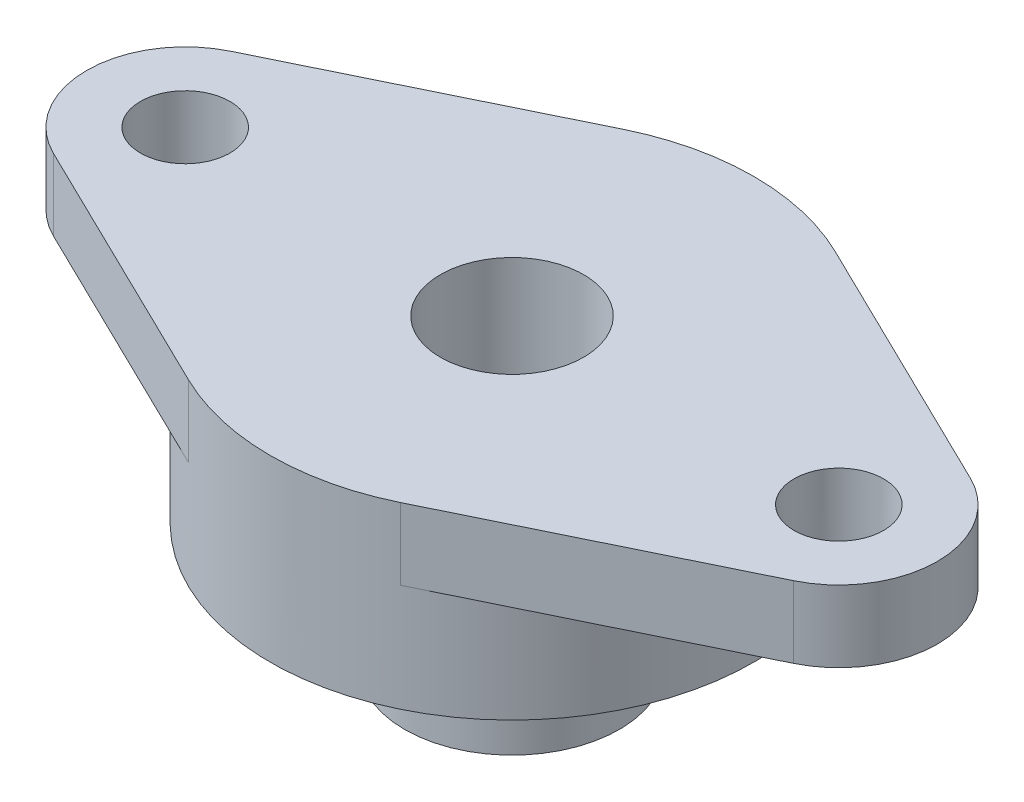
ISO-10303-21;
HEADER;
FILE_DESCRIPTION(('STEP AP214'),'2;1');
FILE_NAME('part.step','',(''),(''),'','','');
FILE_SCHEMA(('AUTOMOTIVE_DESIGN { 1 0 10303 214 1 1 1 1 }'));
ENDSEC;
DATA;
#1=APPLICATION_CONTEXT('core data for automotive mechanical design processes');
#2=APPLICATION_PROTOCOL_DEFINITION('international standard','automotive_design',2000,#1);
#3=PRODUCT_CONTEXT('',#1,'mechanical');
#4=PRODUCT('Part','Part','',(#3));
#5=PRODUCT_RELATED_PRODUCT_CATEGORY('part','',(#4));
#6=PRODUCT_DEFINITION_FORMATION('','',#4);
#7=PRODUCT_DEFINITION_CONTEXT('part definition',#1,'design');
#8=PRODUCT_DEFINITION('design','',#6,#7);
#9=PRODUCT_DEFINITION_SHAPE('','',#8);
#10=(LENGTH_UNIT() NAMED_UNIT(*) SI_UNIT(.MILLI.,.METRE.));
#11=(NAMED_UNIT(*) PLANE_ANGLE_UNIT() SI_UNIT($,.RADIAN.));
#12=(NAMED_UNIT(*) SI_UNIT($,.STERADIAN.) SOLID_ANGLE_UNIT());
#13=UNCERTAINTY_MEASURE_WITH_UNIT(LENGTH_MEASURE(1.E-05),#10,'distance_accuracy_value','');
#14=(GEOMETRIC_REPRESENTATION_CONTEXT(3) GLOBAL_UNCERTAINTY_ASSIGNED_CONTEXT((#13)) GLOBAL_UNIT_ASSIGNED_CONTEXT((#10,
#11,#12)) REPRESENTATION_CONTEXT('',''));
#15=CARTESIAN_POINT('',(0.,0.,0.));
#16=DIRECTION('',(0.,0.,1.));
#17=DIRECTION('',(1.,0.,0.));
#18=AXIS2_PLACEMENT_3D('',#15,#16,#17);
#19=CARTESIAN_POINT('',(18.2499999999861,0.,-7.3341526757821E-11));
#20=DIRECTION('',(0.,-1.,0.));
#21=DIRECTION('',(0.,0.,-1.));
#22=AXIS2_PLACEMENT_3D('',#19,#20,#21);
#23=PLANE('',#22);
#24=CARTESIAN_POINT('',(18.25,0.,0.));
#25=DIRECTION('',(0.,-1.,0.));
#26=DIRECTION('',(0.,0.,-1.));
#27=AXIS2_PLACEMENT_3D('',#24,#25,#26);
#28=CIRCLE('',#27,2.49999999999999);
#29=CARTESIAN_POINT('',(18.25,0.,-2.49999999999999));
#30=VERTEX_POINT('',#29);
#31=EDGE_CURVE('E263',#30,#30,#28,.T.);
#32=ORIENTED_EDGE('',*,*,#31,.F.);
#33=EDGE_LOOP('',(#32));
#34=FACE_BOUND('',#33,.T.);
#35=CARTESIAN_POINT('',(0.,0.,0.));
#36=DIRECTION('',(0.,-1.,0.));
#37=DIRECTION('',(0.,0.,-1.));
#38=AXIS2_PLACEMENT_3D('',#35,#36,#37);
#39=CIRCLE('',#38,13.5);
#40=CARTESIAN_POINT('',(5.91780821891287,0.,-12.1338182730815));
#41=VERTEX_POINT('',#40);
#42=CARTESIAN_POINT('',(5.91780821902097,0.,12.1338182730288));
#43=VERTEX_POINT('',#42);
#44=EDGE_CURVE('E266',#41,#43,#39,.T.);
#45=ORIENTED_EDGE('',*,*,#44,.F.);
#46=DIRECTION('',(0.898801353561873,0.,0.438356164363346));
#47=VECTOR('',#46,1.);
#48=CARTESIAN_POINT('',(5.91780821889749,0.,-12.13381827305));
#49=LINE('',#48,#47);
#50=CARTESIAN_POINT('',(20.6609589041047,0.,-4.94340744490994));
#51=VERTEX_POINT('',#50);
#52=EDGE_CURVE('E164',#41,#51,#49,.T.);
#53=ORIENTED_EDGE('',*,*,#52,.T.);
#54=CARTESIAN_POINT('',(18.2499999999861,0.,-7.3341526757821E-11));
#55=DIRECTION('',(0.,-1.,0.));
#56=DIRECTION('',(0.,0.,-1.));
#57=AXIS2_PLACEMENT_3D('',#54,#55,#56);
#58=CIRCLE('',#57,5.50000000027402);
#59=CARTESIAN_POINT('',(20.660958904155,0.,4.94340744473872));
#60=VERTEX_POINT('',#59);
#61=EDGE_CURVE('E149',#51,#60,#58,.T.);
#62=ORIENTED_EDGE('',*,*,#61,.T.);
#63=DIRECTION('',(-0.898801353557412,0.,0.438356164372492));
#64=VECTOR('',#63,1.);
#65=CARTESIAN_POINT('',(20.660958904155,0.,4.94340744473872));
#66=LINE('',#65,#64);
#67=EDGE_CURVE('E152',#60,#43,#66,.T.);
#68=ORIENTED_EDGE('',*,*,#67,.T.);
#69=EDGE_LOOP('',(#45,#53,#62,#68));
#70=FACE_BOUND('',#69,.T.);
#71=ADVANCED_FACE('F43',(#34,#70),#23,.T.);
#72=CARTESIAN_POINT('',(18.2499999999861,4.,-7.3341526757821E-11));
#73=DIRECTION('',(0.,-1.,0.));
#74=DIRECTION('',(0.,0.,-1.));
#75=AXIS2_PLACEMENT_3D('',#72,#73,#74);
#76=CYLINDRICAL_SURFACE('',#75,5.50000000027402);
#77=ORIENTED_EDGE('',*,*,#61,.F.);
#78=DIRECTION('',(0.,-1.,0.));
#79=VECTOR('',#78,1.);
#80=CARTESIAN_POINT('',(20.6609589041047,4.,-4.94340744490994));
#81=LINE('',#80,#79);
#82=CARTESIAN_POINT('',(20.6609589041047,4.,-4.94340744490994));
#83=VERTEX_POINT('',#82);
#84=EDGE_CURVE('E65',#83,#51,#81,.T.);
#85=ORIENTED_EDGE('',*,*,#84,.F.);
#86=CARTESIAN_POINT('',(18.2499999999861,4.,-7.3341526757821E-11));
#87=DIRECTION('',(0.,-1.,0.));
#88=DIRECTION('',(0.,0.,-1.));
#89=AXIS2_PLACEMENT_3D('',#86,#87,#88);
#90=CIRCLE('',#89,5.50000000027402);
#91=CARTESIAN_POINT('',(20.660958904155,4.,4.94340744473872));
#92=VERTEX_POINT('',#91);
#93=EDGE_CURVE('E167',#83,#92,#90,.T.);
#94=ORIENTED_EDGE('',*,*,#93,.T.);
#95=DIRECTION('',(0.,-1.,0.));
#96=VECTOR('',#95,1.);
#97=CARTESIAN_POINT('',(20.660958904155,4.,4.94340744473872));
#98=LINE('',#97,#96);
#99=EDGE_CURVE('E105',#92,#60,#98,.T.);
#100=ORIENTED_EDGE('',*,*,#99,.T.);
#101=EDGE_LOOP('',(#77,#85,#94,#100));
#102=FACE_BOUND('',#101,.T.);
#103=ADVANCED_FACE('F45',(#102),#76,.T.);
#104=CARTESIAN_POINT('',(5.91780821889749,4.,-12.13381827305));
#105=DIRECTION('',(0.438356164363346,0.,-0.898801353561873));
#106=DIRECTION('',(-0.898801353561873,0.,-0.438356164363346));
#107=AXIS2_PLACEMENT_3D('',#104,#105,#106);
#108=PLANE('',#107);
#109=ORIENTED_EDGE('',*,*,#52,.F.);
#110=DIRECTION('',(0.,-1.,0.));
#111=VECTOR('',#110,1.);
#112=CARTESIAN_POINT('',(5.91780821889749,4.,-12.13381827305));
#113=LINE('',#112,#111);
#114=CARTESIAN_POINT('',(5.91780821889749,4.,-12.13381827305));
#115=VERTEX_POINT('',#114);
#116=EDGE_CURVE('E130',#115,#41,#113,.T.);
#117=ORIENTED_EDGE('',*,*,#116,.F.);
#118=DIRECTION('',(0.898801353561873,0.,0.438356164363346));
#119=VECTOR('',#118,1.);
#120=CARTESIAN_POINT('',(5.91780821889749,4.,-12.13381827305));
#121=LINE('',#120,#119);
#122=EDGE_CURVE('E139',#115,#83,#121,.T.);
#123=ORIENTED_EDGE('',*,*,#122,.T.);
#124=ORIENTED_EDGE('',*,*,#84,.T.);
#125=EDGE_LOOP('',(#109,#117,#123,#124));
#126=FACE_BOUND('',#125,.T.);
#127=ADVANCED_FACE('F236',(#126),#108,.T.);
#128=CARTESIAN_POINT('',(0.,4.,1.95185047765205E-11));
#129=DIRECTION('',(0.,-1.,0.));
#130=DIRECTION('',(0.,0.,-1.));
#131=AXIS2_PLACEMENT_3D('',#128,#129,#130);
#132=CYLINDRICAL_SURFACE('',#131,13.4999999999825);
#133=ORIENTED_EDGE('',*,*,#116,.T.);
#134=ORIENTED_EDGE('',*,*,#44,.T.);
#135=DIRECTION('',(0.,-1.,0.));
#136=VECTOR('',#135,1.);
#137=CARTESIAN_POINT('',(5.91780821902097,4.,12.1338182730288));
#138=LINE('',#137,#136);
#139=CARTESIAN_POINT('',(5.91780821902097,4.,12.1338182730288));
#140=VERTEX_POINT('',#139);
#141=EDGE_CURVE('E175',#140,#43,#138,.T.);
#142=ORIENTED_EDGE('',*,*,#141,.F.);
#143=CARTESIAN_POINT('',(0.,4.,1.95185047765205E-11));
#144=DIRECTION('',(0.,-1.,0.));
#145=DIRECTION('',(0.,0.,-1.));
#146=AXIS2_PLACEMENT_3D('',#143,#144,#145);
#147=CIRCLE('',#146,13.4999999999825);
#148=CARTESIAN_POINT('',(-5.91780821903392,4.,12.1338182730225));
#149=VERTEX_POINT('',#148);
#150=EDGE_CURVE('E278',#140,#149,#147,.T.);
#151=ORIENTED_EDGE('',*,*,#150,.T.);
#152=DIRECTION('',(0.,-1.,0.));
#153=VECTOR('',#152,1.);
#154=CARTESIAN_POINT('',(-5.91780821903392,4.,12.1338182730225));
#155=LINE('',#154,#153);
#156=CARTESIAN_POINT('',(-5.91780821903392,0.,12.1338182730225));
#157=VERTEX_POINT('',#156);
#158=EDGE_CURVE('E173',#149,#157,#155,.T.);
#159=ORIENTED_EDGE('',*,*,#158,.T.);
#160=CARTESIAN_POINT('',(-5.91780821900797,0.,-12.1338182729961));
#161=VERTEX_POINT('',#160);
#162=EDGE_CURVE('E129',#157,#161,#39,.T.);
#163=ORIENTED_EDGE('',*,*,#162,.T.);
#164=DIRECTION('',(0.,-1.,0.));
#165=VECTOR('',#164,1.);
#166=CARTESIAN_POINT('',(-5.91780821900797,4.,-12.1338182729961));
#167=LINE('',#166,#165);
#168=CARTESIAN_POINT('',(-5.91780821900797,4.,-12.1338182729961));
#169=VERTEX_POINT('',#168);
#170=EDGE_CURVE('E93',#169,#161,#167,.T.);
#171=ORIENTED_EDGE('',*,*,#170,.F.);
#172=CARTESIAN_POINT('',(0.,4.,1.95185047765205E-11));
#173=DIRECTION('',(0.,-1.,0.));
#174=DIRECTION('',(0.,0.,-1.));
#175=AXIS2_PLACEMENT_3D('',#172,#173,#174);
#176=CIRCLE('',#175,13.4999999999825);
#177=EDGE_CURVE('E126',#169,#115,#176,.T.);
#178=ORIENTED_EDGE('',*,*,#177,.T.);
#179=EDGE_LOOP('',(#133,#134,#142,#151,#159,#163,#171,#178));
#180=FACE_BOUND('',#179,.T.);
#181=CARTESIAN_POINT('',(0.,-6.,0.));
#182=DIRECTION('',(0.,-1.,0.));
#183=DIRECTION('',(0.,0.,-1.));
#184=AXIS2_PLACEMENT_3D('',#181,#182,#183);
#185=CIRCLE('',#184,13.5);
#186=CARTESIAN_POINT('',(0.,-6.,-13.5));
#187=VERTEX_POINT('',#186);
#188=EDGE_CURVE('E153',#187,#187,#185,.T.);
#189=ORIENTED_EDGE('',*,*,#188,.F.);
#190=EDGE_LOOP('',(#189));
#191=FACE_BOUND('',#190,.T.);
#192=ADVANCED_FACE('F124',(#180,#191),#132,.T.);
#193=CARTESIAN_POINT('',(-20.6609589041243,4.,-4.94340744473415));
#194=DIRECTION('',(-0.438356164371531,0.,-0.898801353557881));
#195=DIRECTION('',(-0.898801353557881,0.,0.438356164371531));
#196=AXIS2_PLACEMENT_3D('',#193,#194,#195);
#197=PLANE('',#196);
#198=DIRECTION('',(0.898801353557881,0.,-0.438356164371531));
#199=VECTOR('',#198,1.);
#200=CARTESIAN_POINT('',(-20.6609589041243,0.,-4.94340744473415));
#201=LINE('',#200,#199);
#202=CARTESIAN_POINT('',(-20.6609589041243,0.,-4.94340744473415));
#203=VERTEX_POINT('',#202);
#204=EDGE_CURVE('E162',#203,#161,#201,.T.);
#205=ORIENTED_EDGE('',*,*,#204,.F.);
#206=DIRECTION('',(0.,-1.,0.));
#207=VECTOR('',#206,1.);
#208=CARTESIAN_POINT('',(-20.6609589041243,4.,-4.94340744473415));
#209=LINE('',#208,#207);
#210=CARTESIAN_POINT('',(-20.6609589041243,4.,-4.94340744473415));
#211=VERTEX_POINT('',#210);
#212=EDGE_CURVE('E131',#211,#203,#209,.T.);
#213=ORIENTED_EDGE('',*,*,#212,.F.);
#214=DIRECTION('',(0.898801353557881,0.,-0.438356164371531));
#215=VECTOR('',#214,1.);
#216=CARTESIAN_POINT('',(-20.6609589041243,4.,-4.94340744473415));
#217=LINE('',#216,#215);
#218=EDGE_CURVE('E137',#211,#169,#217,.T.);
#219=ORIENTED_EDGE('',*,*,#218,.T.);
#220=ORIENTED_EDGE('',*,*,#170,.T.);
#221=EDGE_LOOP('',(#205,#213,#219,#220));
#222=FACE_BOUND('',#221,.T.);
#223=ADVANCED_FACE('F141',(#222),#197,.T.);
#224=CARTESIAN_POINT('',(-18.25,4.,0.));
#225=DIRECTION('',(0.,-1.,0.));
#226=DIRECTION('',(0.,0.,-1.));
#227=AXIS2_PLACEMENT_3D('',#224,#225,#226);
#228=CYLINDRICAL_SURFACE('',#227,5.50000000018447);
#229=CARTESIAN_POINT('',(-18.25,0.,0.));
#230=DIRECTION('',(0.,-1.,0.));
#231=DIRECTION('',(0.,0.,-1.));
#232=AXIS2_PLACEMENT_3D('',#229,#230,#231);
#233=CIRCLE('',#232,5.50000000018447);
#234=CARTESIAN_POINT('',(-20.6609589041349,0.,4.94340744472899));
#235=VERTEX_POINT('',#234);
#236=EDGE_CURVE('E159',#235,#203,#233,.T.);
#237=ORIENTED_EDGE('',*,*,#236,.F.);
#238=DIRECTION('',(0.,-1.,0.));
#239=VECTOR('',#238,1.);
#240=CARTESIAN_POINT('',(-20.6609589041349,4.,4.94340744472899));
#241=LINE('',#240,#239);
#242=CARTESIAN_POINT('',(-20.6609589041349,4.,4.94340744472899));
#243=VERTEX_POINT('',#242);
#244=EDGE_CURVE('E171',#243,#235,#241,.T.);
#245=ORIENTED_EDGE('',*,*,#244,.F.);
#246=CARTESIAN_POINT('',(-18.25,4.,0.));
#247=DIRECTION('',(0.,-1.,0.));
#248=DIRECTION('',(0.,0.,-1.));
#249=AXIS2_PLACEMENT_3D('',#246,#247,#248);
#250=CIRCLE('',#249,5.50000000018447);
#251=EDGE_CURVE('E142',#243,#211,#250,.T.);
#252=ORIENTED_EDGE('',*,*,#251,.T.);
#253=ORIENTED_EDGE('',*,*,#212,.T.);
#254=EDGE_LOOP('',(#237,#245,#252,#253));
#255=FACE_BOUND('',#254,.T.);
#256=ADVANCED_FACE('F243',(#255),#228,.T.);
#257=CARTESIAN_POINT('',(-5.91780821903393,4.,12.1338182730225));
#258=DIRECTION('',(-0.438356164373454,0.,0.898801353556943));
#259=DIRECTION('',(0.898801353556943,0.,0.438356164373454));
#260=AXIS2_PLACEMENT_3D('',#257,#258,#259);
#261=PLANE('',#260);
#262=DIRECTION('',(-0.898801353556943,0.,-0.438356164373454));
#263=VECTOR('',#262,1.);
#264=CARTESIAN_POINT('',(-5.91780821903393,0.,12.1338182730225));
#265=LINE('',#264,#263);
#266=EDGE_CURVE('E156',#157,#235,#265,.T.);
#267=ORIENTED_EDGE('',*,*,#266,.F.);
#268=ORIENTED_EDGE('',*,*,#158,.F.);
#269=DIRECTION('',(-0.898801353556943,0.,-0.438356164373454));
#270=VECTOR('',#269,1.);
#271=CARTESIAN_POINT('',(-5.91780821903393,4.,12.1338182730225));
#272=LINE('',#271,#270);
#273=EDGE_CURVE('E144',#149,#243,#272,.T.);
#274=ORIENTED_EDGE('',*,*,#273,.T.);
#275=ORIENTED_EDGE('',*,*,#244,.T.);
#276=EDGE_LOOP('',(#267,#268,#274,#275));
#277=FACE_BOUND('',#276,.T.);
#278=ADVANCED_FACE('F246',(#277),#261,.T.);
#279=CARTESIAN_POINT('',(20.660958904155,4.,4.94340744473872));
#280=DIRECTION('',(0.438356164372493,0.,0.898801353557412));
#281=DIRECTION('',(0.898801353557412,0.,-0.438356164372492));
#282=AXIS2_PLACEMENT_3D('',#279,#280,#281);
#283=PLANE('',#282);
#284=ORIENTED_EDGE('',*,*,#67,.F.);
#285=ORIENTED_EDGE('',*,*,#99,.F.);
#286=DIRECTION('',(-0.898801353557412,0.,0.438356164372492));
#287=VECTOR('',#286,1.);
#288=CARTESIAN_POINT('',(20.660958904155,4.,4.94340744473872));
#289=LINE('',#288,#287);
#290=EDGE_CURVE('E276',#92,#140,#289,.T.);
#291=ORIENTED_EDGE('',*,*,#290,.T.);
#292=ORIENTED_EDGE('',*,*,#141,.T.);
#293=EDGE_LOOP('',(#284,#285,#291,#292));
#294=FACE_BOUND('',#293,.T.);
#295=ADVANCED_FACE('F231',(#294),#283,.T.);
#296=CARTESIAN_POINT('',(18.2499999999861,4.,-7.3341526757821E-11));
#297=DIRECTION('',(0.,-1.,0.));
#298=DIRECTION('',(0.,0.,-1.));
#299=AXIS2_PLACEMENT_3D('',#296,#297,#298);
#300=PLANE('',#299);
#301=CARTESIAN_POINT('',(-18.25,4.,0.));
#302=DIRECTION('',(0.,-1.,0.));
#303=DIRECTION('',(0.,0.,-1.));
#304=AXIS2_PLACEMENT_3D('',#301,#302,#303);
#305=CIRCLE('',#304,2.49999999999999);
#306=CARTESIAN_POINT('',(-18.25,4.,-2.49999999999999));
#307=VERTEX_POINT('',#306);
#308=EDGE_CURVE('E324',#307,#307,#305,.T.);
#309=ORIENTED_EDGE('',*,*,#308,.T.);
#310=EDGE_LOOP('',(#309));
#311=FACE_BOUND('',#310,.T.);
#312=CARTESIAN_POINT('',(18.25,4.,0.));
#313=DIRECTION('',(0.,1.,0.));
#314=DIRECTION('',(0.,0.,1.));
#315=AXIS2_PLACEMENT_3D('',#312,#313,#314);
#316=CIRCLE('',#315,2.49999999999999);
#317=CARTESIAN_POINT('',(18.25,4.,2.49999999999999));
#318=VERTEX_POINT('',#317);
#319=EDGE_CURVE('E322',#318,#318,#316,.T.);
#320=ORIENTED_EDGE('',*,*,#319,.F.);
#321=EDGE_LOOP('',(#320));
#322=FACE_BOUND('',#321,.T.);
#323=CARTESIAN_POINT('',(0.,4.,0.));
#324=DIRECTION('',(0.,1.,0.));
#325=DIRECTION('',(0.,0.,1.));
#326=AXIS2_PLACEMENT_3D('',#323,#324,#325);
#327=CIRCLE('',#326,3.99999999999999);
#328=CARTESIAN_POINT('',(0.,4.,3.99999999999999));
#329=VERTEX_POINT('',#328);
#330=EDGE_CURVE('E202',#329,#329,#327,.T.);
#331=ORIENTED_EDGE('',*,*,#330,.F.);
#332=EDGE_LOOP('',(#331));
#333=FACE_BOUND('',#332,.T.);
#334=ORIENTED_EDGE('',*,*,#93,.F.);
#335=ORIENTED_EDGE('',*,*,#122,.F.);
#336=ORIENTED_EDGE('',*,*,#177,.F.);
#337=ORIENTED_EDGE('',*,*,#218,.F.);
#338=ORIENTED_EDGE('',*,*,#251,.F.);
#339=ORIENTED_EDGE('',*,*,#273,.F.);
#340=ORIENTED_EDGE('',*,*,#150,.F.);
#341=ORIENTED_EDGE('',*,*,#290,.F.);
#342=EDGE_LOOP('',(#334,#335,#336,#337,#338,#339,#340,#341));
#343=FACE_BOUND('',#342,.T.);
#344=ADVANCED_FACE('F135',(#311,#322,#333,#343),#300,.F.);
#345=CARTESIAN_POINT('',(-18.25,0.,0.));
#346=DIRECTION('',(0.,-1.,0.));
#347=DIRECTION('',(0.,0.,-1.));
#348=AXIS2_PLACEMENT_3D('',#345,#346,#347);
#349=CIRCLE('',#348,2.49999999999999);
#350=CARTESIAN_POINT('',(-18.25,0.,-2.49999999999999));
#351=VERTEX_POINT('',#350);
#352=EDGE_CURVE('E329',#351,#351,#349,.T.);
#353=ORIENTED_EDGE('',*,*,#352,.F.);
#354=EDGE_LOOP('',(#353));
#355=FACE_BOUND('',#354,.T.);
#356=ORIENTED_EDGE('',*,*,#162,.F.);
#357=ORIENTED_EDGE('',*,*,#266,.T.);
#358=ORIENTED_EDGE('',*,*,#236,.T.);
#359=ORIENTED_EDGE('',*,*,#204,.T.);
#360=EDGE_LOOP('',(#356,#357,#358,#359));
#361=FACE_BOUND('',#360,.T.);
#362=ADVANCED_FACE('F227',(#355,#361),#23,.T.);
#363=CARTESIAN_POINT('',(0.,-6.,0.));
#364=DIRECTION('',(0.,-1.,0.));
#365=DIRECTION('',(0.,0.,-1.));
#366=AXIS2_PLACEMENT_3D('',#363,#364,#365);
#367=PLANE('',#366);
#368=CARTESIAN_POINT('',(0.,-6.,0.));
#369=DIRECTION('',(0.,-1.,0.));
#370=DIRECTION('',(0.,0.,-1.));
#371=AXIS2_PLACEMENT_3D('',#368,#369,#370);
#372=CIRCLE('',#371,11.5);
#373=CARTESIAN_POINT('',(0.,-6.,-11.5));
#374=VERTEX_POINT('',#373);
#375=EDGE_CURVE('E272',#374,#374,#372,.T.);
#376=ORIENTED_EDGE('',*,*,#375,.F.);
#377=EDGE_LOOP('',(#376));
#378=FACE_BOUND('',#377,.T.);
#379=ORIENTED_EDGE('',*,*,#188,.T.);
#380=EDGE_LOOP('',(#379));
#381=FACE_BOUND('',#380,.T.);
#382=ADVANCED_FACE('F223',(#378,#381),#367,.T.);
#383=CARTESIAN_POINT('',(0.,-4.00000000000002,0.));
#384=DIRECTION('',(0.,1.,0.));
#385=DIRECTION('',(0.,0.,1.));
#386=AXIS2_PLACEMENT_3D('',#383,#384,#385);
#387=PLANE('',#386);
#388=CARTESIAN_POINT('',(0.,-4.,0.));
#389=DIRECTION('',(0.,1.,0.));
#390=DIRECTION('',(0.,0.,1.));
#391=AXIS2_PLACEMENT_3D('',#388,#389,#390);
#392=CIRCLE('',#391,5.99999999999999);
#393=CARTESIAN_POINT('',(0.,-4.,5.99999999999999));
#394=VERTEX_POINT('',#393);
#395=EDGE_CURVE('E292',#394,#394,#392,.T.);
#396=ORIENTED_EDGE('',*,*,#395,.T.);
#397=EDGE_LOOP('',(#396));
#398=FACE_BOUND('',#397,.T.);
#399=CARTESIAN_POINT('',(0.,-4.,0.));
#400=DIRECTION('',(0.,-1.,0.));
#401=DIRECTION('',(0.,0.,-1.));
#402=AXIS2_PLACEMENT_3D('',#399,#400,#401);
#403=CIRCLE('',#402,11.5);
#404=CARTESIAN_POINT('',(0.,-4.,-11.5));
#405=VERTEX_POINT('',#404);
#406=EDGE_CURVE('E267',#405,#405,#403,.T.);
#407=ORIENTED_EDGE('',*,*,#406,.T.);
#408=EDGE_LOOP('',(#407));
#409=FACE_BOUND('',#408,.T.);
#410=ADVANCED_FACE('F219',(#398,#409),#387,.F.);
#411=CARTESIAN_POINT('',(0.,-6.,0.));
#412=DIRECTION('',(0.,-1.,0.));
#413=DIRECTION('',(0.,0.,-1.));
#414=AXIS2_PLACEMENT_3D('',#411,#412,#413);
#415=CYLINDRICAL_SURFACE('',#414,11.5);
#416=ORIENTED_EDGE('',*,*,#406,.F.);
#417=EDGE_LOOP('',(#416));
#418=FACE_BOUND('',#417,.T.);
#419=ORIENTED_EDGE('',*,*,#375,.T.);
#420=EDGE_LOOP('',(#419));
#421=FACE_BOUND('',#420,.T.);
#422=ADVANCED_FACE('F214',(#418,#421),#415,.F.);
#423=CARTESIAN_POINT('',(0.,-13.,0.));
#424=DIRECTION('',(0.,1.,0.));
#425=DIRECTION('',(0.,0.,1.));
#426=AXIS2_PLACEMENT_3D('',#423,#424,#425);
#427=CYLINDRICAL_SURFACE('',#426,6.);
#428=CARTESIAN_POINT('',(1.24999999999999,-10.29269596,-5.86834729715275));
#429=CARTESIAN_POINT('',(1.24999750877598,-10.362086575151,-5.86834869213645));
#430=CARTESIAN_POINT('',(1.24420229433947,-10.4315079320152,-5.86959145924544));
#431=CARTESIAN_POINT('',(1.22119649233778,-10.5683822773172,-5.87442015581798));
#432=CARTESIAN_POINT('',(1.20397715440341,-10.6358337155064,-5.87800788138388));
#433=CARTESIAN_POINT('',(1.15868397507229,-10.7667683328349,-5.8871029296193));
#434=CARTESIAN_POINT('',(1.13062141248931,-10.8302555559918,-5.89260825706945));
#435=CARTESIAN_POINT('',(1.06446988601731,-10.9516204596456,-5.90491581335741));
#436=CARTESIAN_POINT('',(1.02638132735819,-11.00949836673,-5.91171798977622));
#437=CARTESIAN_POINT('',(0.940636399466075,-11.1188913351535,-5.92596934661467));
#438=CARTESIAN_POINT('',(0.892855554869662,-11.1703078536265,-5.93342614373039));
#439=CARTESIAN_POINT('',(0.789351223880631,-11.2644570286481,-5.94807966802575));
#440=CARTESIAN_POINT('',(0.733627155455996,-11.3071890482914,-5.95527637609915));
#441=CARTESIAN_POINT('',(0.615162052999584,-11.3831418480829,-5.96868135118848));
#442=CARTESIAN_POINT('',(0.552359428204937,-11.4162684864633,-5.97487958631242));
#443=CARTESIAN_POINT('',(0.421928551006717,-11.4714620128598,-5.98550347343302));
#444=CARTESIAN_POINT('',(0.354300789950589,-11.4935300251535,-5.98992930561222));
#445=CARTESIAN_POINT('',(0.217162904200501,-11.5256717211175,-5.99645589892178));
#446=CARTESIAN_POINT('',(0.147693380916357,-11.5359119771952,-5.99858891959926));
#447=CARTESIAN_POINT('',(0.00799184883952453,-11.544627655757,-6.00040112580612));
#448=CARTESIAN_POINT('',(-0.0622400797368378,-11.5431043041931,-6.0000805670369));
#449=CARTESIAN_POINT('',(-0.20032658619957,-11.5284613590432,-5.99704658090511));
#450=CARTESIAN_POINT('',(-0.268201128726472,-11.5155212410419,-5.99437018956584));
#451=CARTESIAN_POINT('',(-0.400793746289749,-11.4786973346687,-5.98696720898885));
#452=CARTESIAN_POINT('',(-0.465511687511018,-11.4548130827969,-5.98224053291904));
#453=CARTESIAN_POINT('',(-0.590460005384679,-11.3966159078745,-5.97120767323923));
#454=CARTESIAN_POINT('',(-0.650657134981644,-11.3622336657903,-5.96489104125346));
#455=CARTESIAN_POINT('',(-0.764493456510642,-11.2840679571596,-5.95137300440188));
#456=CARTESIAN_POINT('',(-0.818131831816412,-11.2402833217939,-5.94417148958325));
#457=CARTESIAN_POINT('',(-0.918394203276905,-11.1435743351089,-5.92951700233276));
#458=CARTESIAN_POINT('',(-0.964866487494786,-11.090492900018,-5.92206184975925));
#459=CARTESIAN_POINT('',(-1.04827597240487,-10.9772139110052,-5.90786872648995));
#460=CARTESIAN_POINT('',(-1.08521296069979,-10.9170161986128,-5.9011307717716));
#461=CARTESIAN_POINT('',(-1.14856217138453,-10.7909837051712,-5.88912998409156));
#462=CARTESIAN_POINT('',(-1.17494805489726,-10.7251353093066,-5.88387085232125));
#463=CARTESIAN_POINT('',(-1.21623577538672,-10.5898043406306,-5.8754760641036));
#464=CARTESIAN_POINT('',(-1.23113924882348,-10.5203222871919,-5.87234010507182));
#465=CARTESIAN_POINT('',(-1.24880863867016,-10.3810762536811,-5.86860783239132));
#466=CARTESIAN_POINT('',(-1.25179442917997,-10.311341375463,-5.86796551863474));
#467=CARTESIAN_POINT('',(-1.24613693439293,-10.1723701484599,-5.86916952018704));
#468=CARTESIAN_POINT('',(-1.23749436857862,-10.1031337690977,-5.87101568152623));
#469=CARTESIAN_POINT('',(-1.20901558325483,-9.96787544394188,-5.87694538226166));
#470=CARTESIAN_POINT('',(-1.1892984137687,-9.90182729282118,-5.88100511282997));
#471=CARTESIAN_POINT('',(-1.13935810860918,-9.7739719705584,-5.8908833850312));
#472=CARTESIAN_POINT('',(-1.10913404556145,-9.71216517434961,-5.89670208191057));
#473=CARTESIAN_POINT('',(-1.03854598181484,-9.59358951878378,-5.90954501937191));
#474=CARTESIAN_POINT('',(-0.998045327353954,-9.53690375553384,-5.91658506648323));
#475=CARTESIAN_POINT('',(-0.908234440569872,-9.43105271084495,-5.93103483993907));
#476=CARTESIAN_POINT('',(-0.858923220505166,-9.38188827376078,-5.93844460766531));
#477=CARTESIAN_POINT('',(-0.751900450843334,-9.29163324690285,-5.95294924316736));
#478=CARTESIAN_POINT('',(-0.694061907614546,-9.25069186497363,-5.9600367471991));
#479=CARTESIAN_POINT('',(-0.572200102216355,-9.17910720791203,-5.97296708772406));
#480=CARTESIAN_POINT('',(-0.508177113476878,-9.14846347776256,-5.97880997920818));
#481=CARTESIAN_POINT('',(-0.376142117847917,-9.09855728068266,-5.98856148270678));
#482=CARTESIAN_POINT('',(-0.308156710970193,-9.07922679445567,-5.99248163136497));
#483=CARTESIAN_POINT('',(-0.169813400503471,-9.05228155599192,-5.99799561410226));
#484=CARTESIAN_POINT('',(-0.0994558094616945,-9.04466526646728,-5.99958975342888));
#485=CARTESIAN_POINT('',(0.0402133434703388,-9.0414283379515,-6.00026408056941));
#486=CARTESIAN_POINT('',(0.109519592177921,-9.04558406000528,-5.99939113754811));
#487=CARTESIAN_POINT('',(0.24642287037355,-9.06527659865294,-5.99532874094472));
#488=CARTESIAN_POINT('',(0.3140199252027,-9.08081324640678,-5.99213932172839));
#489=CARTESIAN_POINT('',(0.445431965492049,-9.12272375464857,-5.98380460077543));
#490=CARTESIAN_POINT('',(0.50925655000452,-9.14906862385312,-5.97866453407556));
#491=CARTESIAN_POINT('',(0.631610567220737,-9.21181835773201,-5.96697995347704));
#492=CARTESIAN_POINT('',(0.690139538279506,-9.24822409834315,-5.96043531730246));
#493=CARTESIAN_POINT('',(0.801340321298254,-9.33080562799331,-5.94651596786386));
#494=CARTESIAN_POINT('',(0.853892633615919,-9.37714024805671,-5.93912880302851));
#495=CARTESIAN_POINT('',(0.950552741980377,-9.47794046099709,-5.92442786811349));
#496=CARTESIAN_POINT('',(0.994658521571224,-9.53240798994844,-5.91711411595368));
#497=CARTESIAN_POINT('',(1.07367451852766,-9.64870506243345,-5.90329191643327));
#498=CARTESIAN_POINT('',(1.10846928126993,-9.7106143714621,-5.89679406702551));
#499=CARTESIAN_POINT('',(1.16710627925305,-9.83952111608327,-5.88547039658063));
#500=CARTESIAN_POINT('',(1.19095816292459,-9.90651400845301,-5.880643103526));
#501=CARTESIAN_POINT('',(1.2225655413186,-10.0268022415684,-5.87414004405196));
#502=CARTESIAN_POINT('',(1.23283449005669,-10.0794254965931,-5.87198163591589));
#503=CARTESIAN_POINT('',(1.24655254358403,-10.185591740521,-5.86908475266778));
#504=CARTESIAN_POINT('',(1.2500019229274,-10.23913469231,-5.86834622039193));
#505=CARTESIAN_POINT('',(1.24999999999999,-10.29269596,-5.86834729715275));
#506=B_SPLINE_CURVE_WITH_KNOTS('',3,(#428,#429,#430,#431,#432,#433,#434,#435,#436,#437,#438,
#439,#440,#441,#442,#443,#444,#445,#446,#447,#448,#449,#450,#451,#452,#453,#454,#455,#456,#457,
#458,#459,#460,#461,#462,#463,#464,#465,#466,#467,#468,#469,#470,#471,#472,#473,#474,#475,#476,
#477,#478,#479,#480,#481,#482,#483,#484,#485,#486,#487,#488,#489,#490,#491,#492,#493,#494,#495,
#496,#497,#498,#499,#500,#501,#502,#503,#504,#505),.UNSPECIFIED.,.T.,.F.,(4,2,2,2,2,2,2,2,2,2,2,
2,2,2,2,2,2,2,2,2,2,2,2,2,2,2,2,2,2,2,2,2,2,2,2,2,2,2,4),(0.,0.207975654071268,
0.416110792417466,0.624030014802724,0.831940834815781,1.04271333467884,1.25350128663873,
1.46629026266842,1.67905760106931,1.88879048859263,2.09850151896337,2.30497341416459,
2.51145405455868,2.71932871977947,2.92722924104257,3.13905862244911,3.35089272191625,
3.56325237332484,3.77558175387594,3.98397516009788,4.1923556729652,4.39853786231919,
4.60473825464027,4.81383917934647,5.02296356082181,5.23559458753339,5.44821621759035,
5.65954599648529,5.87084803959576,6.07816293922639,6.28547476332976,6.49223410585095,
6.69901145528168,6.90938318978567,7.11980508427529,7.33272651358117,7.54545984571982,
7.70599867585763,7.86653104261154),.UNSPECIFIED.);
#507=CARTESIAN_POINT('',(1.24999999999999,-10.29269596,-5.86834729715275));
#508=VERTEX_POINT('',#507);
#509=EDGE_CURVE('E203',#508,#508,#506,.T.);
#510=ORIENTED_EDGE('',*,*,#509,.F.);
#511=EDGE_LOOP('',(#510));
#512=FACE_BOUND('',#511,.T.);
#513=CARTESIAN_POINT('',(5.86834729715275,-10.29269596,1.24999999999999));
#514=CARTESIAN_POINT('',(5.86834869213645,-10.362086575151,1.24999750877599));
#515=CARTESIAN_POINT('',(5.86959145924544,-10.4315079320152,1.24420229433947));
#516=CARTESIAN_POINT('',(5.87442015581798,-10.5683822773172,1.22119649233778));
#517=CARTESIAN_POINT('',(5.87800788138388,-10.6358337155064,1.20397715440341));
#518=CARTESIAN_POINT('',(5.8871029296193,-10.7667683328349,1.1586839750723));
#519=CARTESIAN_POINT('',(5.89260825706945,-10.8302555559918,1.13062141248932));
#520=CARTESIAN_POINT('',(5.90491581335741,-10.9516204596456,1.06446988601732));
#521=CARTESIAN_POINT('',(5.91171798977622,-11.00949836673,1.02638132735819));
#522=CARTESIAN_POINT('',(5.92596934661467,-11.1188913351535,0.940636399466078));
#523=CARTESIAN_POINT('',(5.93342614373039,-11.1703078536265,0.892855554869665));
#524=CARTESIAN_POINT('',(5.94807966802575,-11.2644570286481,0.789351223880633));
#525=CARTESIAN_POINT('',(5.95527637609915,-11.3071890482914,0.733627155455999));
#526=CARTESIAN_POINT('',(5.96868135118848,-11.3831418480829,0.615162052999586));
#527=CARTESIAN_POINT('',(5.97487958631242,-11.4162684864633,0.55235942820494));
#528=CARTESIAN_POINT('',(5.98550347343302,-11.4714620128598,0.421928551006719));
#529=CARTESIAN_POINT('',(5.98992930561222,-11.4935300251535,0.354300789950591));
#530=CARTESIAN_POINT('',(5.99645589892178,-11.5256717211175,0.217162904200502));
#531=CARTESIAN_POINT('',(5.99858891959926,-11.5359119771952,0.147693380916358));
#532=CARTESIAN_POINT('',(6.00040112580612,-11.544627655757,0.00799184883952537));
#533=CARTESIAN_POINT('',(6.0000805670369,-11.5431043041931,-0.0622400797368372));
#534=CARTESIAN_POINT('',(5.99704658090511,-11.5284613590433,-0.20032658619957));
#535=CARTESIAN_POINT('',(5.99437018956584,-11.5155212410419,-0.268201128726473));
#536=CARTESIAN_POINT('',(5.98696720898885,-11.4786973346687,-0.400793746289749));
#537=CARTESIAN_POINT('',(5.98224053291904,-11.4548130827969,-0.465511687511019));
#538=CARTESIAN_POINT('',(5.97120767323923,-11.3966159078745,-0.59046000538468));
#539=CARTESIAN_POINT('',(5.96489104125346,-11.3622336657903,-0.650657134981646));
#540=CARTESIAN_POINT('',(5.95137300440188,-11.2840679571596,-0.764493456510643));
#541=CARTESIAN_POINT('',(5.94417148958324,-11.2402833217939,-0.818131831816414));
#542=CARTESIAN_POINT('',(5.92951700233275,-11.1435743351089,-0.918394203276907));
#543=CARTESIAN_POINT('',(5.92206184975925,-11.0904929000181,-0.964866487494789));
#544=CARTESIAN_POINT('',(5.90786872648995,-10.9772139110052,-1.04827597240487));
#545=CARTESIAN_POINT('',(5.9011307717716,-10.9170161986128,-1.08521296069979));
#546=CARTESIAN_POINT('',(5.88912998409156,-10.7909837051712,-1.14856217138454));
#547=CARTESIAN_POINT('',(5.88387085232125,-10.7251353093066,-1.17494805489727));
#548=CARTESIAN_POINT('',(5.8754760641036,-10.5898043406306,-1.21623577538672));
#549=CARTESIAN_POINT('',(5.87234010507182,-10.5203222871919,-1.23113924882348));
#550=CARTESIAN_POINT('',(5.86860783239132,-10.3810762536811,-1.24880863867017));
#551=CARTESIAN_POINT('',(5.86796551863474,-10.311341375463,-1.25179442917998));
#552=CARTESIAN_POINT('',(5.86916952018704,-10.1723701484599,-1.24613693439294));
#553=CARTESIAN_POINT('',(5.87101568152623,-10.1031337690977,-1.23749436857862));
#554=CARTESIAN_POINT('',(5.87694538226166,-9.96787544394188,-1.20901558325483));
#555=CARTESIAN_POINT('',(5.88100511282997,-9.90182729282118,-1.18929841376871));
#556=CARTESIAN_POINT('',(5.8908833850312,-9.7739719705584,-1.13935810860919));
#557=CARTESIAN_POINT('',(5.89670208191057,-9.7121651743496,-1.10913404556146));
#558=CARTESIAN_POINT('',(5.90954501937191,-9.59358951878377,-1.03854598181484));
#559=CARTESIAN_POINT('',(5.91658506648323,-9.53690375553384,-0.998045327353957));
#560=CARTESIAN_POINT('',(5.93103483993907,-9.43105271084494,-0.908234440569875));
#561=CARTESIAN_POINT('',(5.93844460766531,-9.38188827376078,-0.858923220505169));
#562=CARTESIAN_POINT('',(5.95294924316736,-9.29163324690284,-0.751900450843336));
#563=CARTESIAN_POINT('',(5.9600367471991,-9.25069186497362,-0.694061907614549));
#564=CARTESIAN_POINT('',(5.97296708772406,-9.17910720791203,-0.572200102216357));
#565=CARTESIAN_POINT('',(5.97880997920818,-9.14846347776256,-0.508177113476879));
#566=CARTESIAN_POINT('',(5.98856148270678,-9.09855728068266,-0.376142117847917));
#567=CARTESIAN_POINT('',(5.99248163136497,-9.07922679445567,-0.308156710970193));
#568=CARTESIAN_POINT('',(5.99799561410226,-9.05228155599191,-0.169813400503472));
#569=CARTESIAN_POINT('',(5.99958975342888,-9.04466526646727,-0.0994558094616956));
#570=CARTESIAN_POINT('',(6.00026408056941,-9.04142833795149,0.040213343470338));
#571=CARTESIAN_POINT('',(5.99939113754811,-9.04558406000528,0.10951959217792));
#572=CARTESIAN_POINT('',(5.99532874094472,-9.06527659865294,0.24642287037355));
#573=CARTESIAN_POINT('',(5.99213932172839,-9.08081324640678,0.314019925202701));
#574=CARTESIAN_POINT('',(5.98380460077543,-9.12272375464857,0.44543196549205));
#575=CARTESIAN_POINT('',(5.97866453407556,-9.14906862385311,0.50925655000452));
#576=CARTESIAN_POINT('',(5.96697995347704,-9.21181835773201,0.631610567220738));
#577=CARTESIAN_POINT('',(5.96043531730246,-9.24822409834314,0.690139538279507));
#578=CARTESIAN_POINT('',(5.94651596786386,-9.33080562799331,0.801340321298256));
#579=CARTESIAN_POINT('',(5.93912880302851,-9.37714024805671,0.853892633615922));
#580=CARTESIAN_POINT('',(5.92442786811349,-9.47794046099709,0.95055274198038));
#581=CARTESIAN_POINT('',(5.91711411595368,-9.53240798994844,0.994658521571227));
#582=CARTESIAN_POINT('',(5.90329191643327,-9.64870506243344,1.07367451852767));
#583=CARTESIAN_POINT('',(5.89679406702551,-9.7106143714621,1.10846928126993));
#584=CARTESIAN_POINT('',(5.88547039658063,-9.83952111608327,1.16710627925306));
#585=CARTESIAN_POINT('',(5.880643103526,-9.90651400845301,1.19095816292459));
#586=CARTESIAN_POINT('',(5.87414004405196,-10.0268022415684,1.2225655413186));
#587=CARTESIAN_POINT('',(5.87198163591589,-10.0794254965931,1.2328344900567));
#588=CARTESIAN_POINT('',(5.86908475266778,-10.185591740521,1.24655254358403));
#589=CARTESIAN_POINT('',(5.86834622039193,-10.23913469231,1.2500019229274));
#590=CARTESIAN_POINT('',(5.86834729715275,-10.29269596,1.24999999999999));
#591=B_SPLINE_CURVE_WITH_KNOTS('',3,(#513,#514,#515,#516,#517,#518,#519,#520,#521,#522,#523,
#524,#525,#526,#527,#528,#529,#530,#531,#532,#533,#534,#535,#536,#537,#538,#539,#540,#541,#542,
#543,#544,#545,#546,#547,#548,#549,#550,#551,#552,#553,#554,#555,#556,#557,#558,#559,#560,#561,
#562,#563,#564,#565,#566,#567,#568,#569,#570,#571,#572,#573,#574,#575,#576,#577,#578,#579,#580,
#581,#582,#583,#584,#585,#586,#587,#588,#589,#590),.UNSPECIFIED.,.T.,.F.,(4,2,2,2,2,2,2,2,2,2,2,
2,2,2,2,2,2,2,2,2,2,2,2,2,2,2,2,2,2,2,2,2,2,2,2,2,2,2,4),(0.,0.20797565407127,0.416110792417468,
0.624030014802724,0.831940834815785,1.04271333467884,1.25350128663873,1.46629026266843,
1.67905760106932,1.88879048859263,2.09850151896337,2.3049734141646,2.51145405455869,
2.71932871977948,2.92722924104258,3.13905862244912,3.35089272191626,3.56325237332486,
3.77558175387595,3.9839751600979,4.19235567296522,4.3985378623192,4.60473825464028,
4.81383917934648,5.02296356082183,5.23559458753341,5.44821621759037,5.65954599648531,
5.87084803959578,6.07816293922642,6.28547476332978,6.49223410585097,6.6990114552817,
6.9093831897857,7.11980508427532,7.33272651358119,7.54545984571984,7.70599867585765,
7.86653104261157),.UNSPECIFIED.);
#592=CARTESIAN_POINT('',(5.86834729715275,-10.29269596,1.24999999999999));
#593=VERTEX_POINT('',#592);
#594=EDGE_CURVE('E194',#593,#593,#591,.T.);
#595=ORIENTED_EDGE('',*,*,#594,.F.);
#596=EDGE_LOOP('',(#595));
#597=FACE_BOUND('',#596,.T.);
#598=CARTESIAN_POINT('',(0.,-13.,0.));
#599=DIRECTION('',(0.,1.,0.));
#600=DIRECTION('',(0.,0.,1.));
#601=AXIS2_PLACEMENT_3D('',#598,#599,#600);
#602=CIRCLE('',#601,6.);
#603=CARTESIAN_POINT('',(0.,-13.,6.));
#604=VERTEX_POINT('',#603);
#605=EDGE_CURVE('E289',#604,#604,#602,.T.);
#606=ORIENTED_EDGE('',*,*,#605,.T.);
#607=EDGE_LOOP('',(#606));
#608=FACE_BOUND('',#607,.T.);
#609=ORIENTED_EDGE('',*,*,#395,.F.);
#610=EDGE_LOOP('',(#609));
#611=FACE_BOUND('',#610,.T.);
#612=ADVANCED_FACE('F209',(#512,#597,#608,#611),#427,.T.);
#613=CARTESIAN_POINT('',(6.,-13.,0.));
#614=DIRECTION('',(0.,-1.,0.));
#615=DIRECTION('',(0.,0.,-1.));
#616=AXIS2_PLACEMENT_3D('',#613,#614,#615);
#617=PLANE('',#616);
#618=CARTESIAN_POINT('',(0.,-13.,0.));
#619=DIRECTION('',(0.,1.,0.));
#620=DIRECTION('',(0.,0.,1.));
#621=AXIS2_PLACEMENT_3D('',#618,#619,#620);
#622=CIRCLE('',#621,3.99999999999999);
#623=CARTESIAN_POINT('',(0.,-13.,3.99999999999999));
#624=VERTEX_POINT('',#623);
#625=EDGE_CURVE('E294',#624,#624,#622,.T.);
#626=ORIENTED_EDGE('',*,*,#625,.T.);
#627=EDGE_LOOP('',(#626));
#628=FACE_BOUND('',#627,.T.);
#629=ORIENTED_EDGE('',*,*,#605,.F.);
#630=EDGE_LOOP('',(#629));
#631=FACE_BOUND('',#630,.T.);
#632=ADVANCED_FACE('F213',(#628,#631),#617,.T.);
#633=CARTESIAN_POINT('',(0.,4.,0.));
#634=DIRECTION('',(0.,1.,0.));
#635=DIRECTION('',(0.,0.,1.));
#636=AXIS2_PLACEMENT_3D('',#633,#634,#635);
#637=CYLINDRICAL_SURFACE('',#636,3.99999999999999);
#638=CARTESIAN_POINT('',(1.25000000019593,-10.29269596,-3.7996710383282));
#639=CARTESIAN_POINT('',(1.24999953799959,-10.3610429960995,-3.79967145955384));
#640=CARTESIAN_POINT('',(1.24437538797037,-10.4293947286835,-3.80153531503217));
#641=CARTESIAN_POINT('',(1.2220917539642,-10.5640901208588,-3.80875639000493));
#642=CARTESIAN_POINT('',(1.20542928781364,-10.6304332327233,-3.81411455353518));
#643=CARTESIAN_POINT('',(1.16169788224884,-10.7591408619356,-3.8276593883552));
#644=CARTESIAN_POINT('',(1.13464735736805,-10.8215121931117,-3.83584105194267));
#645=CARTESIAN_POINT('',(1.07096914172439,-10.940848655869,-3.85410406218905));
#646=CARTESIAN_POINT('',(1.03433975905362,-10.9978128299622,-3.86418574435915));
#647=CARTESIAN_POINT('',(0.951196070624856,-11.1066748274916,-3.88550127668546));
#648=CARTESIAN_POINT('',(0.904409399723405,-11.158359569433,-3.89676123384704));
#649=CARTESIAN_POINT('',(0.802862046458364,-11.2532919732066,-3.9189424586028));
#650=CARTESIAN_POINT('',(0.748100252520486,-11.2965384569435,-3.92986367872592));
#651=CARTESIAN_POINT('',(0.630625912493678,-11.3743070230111,-3.95043553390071));
#652=CARTESIAN_POINT('',(0.567761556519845,-11.4086096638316,-3.96005184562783));
#653=CARTESIAN_POINT('',(0.436804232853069,-11.4660720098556,-3.97662551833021));
#654=CARTESIAN_POINT('',(0.368712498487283,-11.4892343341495,-3.98358350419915));
#655=CARTESIAN_POINT('',(0.231464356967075,-11.5230470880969,-3.99387175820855));
#656=CARTESIAN_POINT('',(0.162405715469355,-11.5340617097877,-3.99730738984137));
#657=CARTESIAN_POINT('',(0.0233408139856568,-11.5444203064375,-4.00053595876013));
#658=CARTESIAN_POINT('',(-0.046665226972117,-11.5437669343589,-4.00032972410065));
#659=CARTESIAN_POINT('',(-0.183074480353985,-11.5310476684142,-3.99637116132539));
#660=CARTESIAN_POINT('',(-0.249518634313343,-11.5193765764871,-3.99274150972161));
#661=CARTESIAN_POINT('',(-0.379453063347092,-11.4856009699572,-3.9824948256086));
#662=CARTESIAN_POINT('',(-0.442943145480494,-11.4634957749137,-3.97587759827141));
#663=CARTESIAN_POINT('',(-0.566078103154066,-11.4092257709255,-3.96023459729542));
#664=CARTESIAN_POINT('',(-0.625666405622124,-11.3769411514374,-3.95118033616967));
#665=CARTESIAN_POINT('',(-0.738702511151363,-11.3033248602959,-3.93161722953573));
#666=CARTESIAN_POINT('',(-0.792148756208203,-11.2619909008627,-3.92110801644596));
#667=CARTESIAN_POINT('',(-0.893737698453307,-11.1694223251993,-3.89923670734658));
#668=CARTESIAN_POINT('',(-0.941566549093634,-11.1178468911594,-3.88785731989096));
#669=CARTESIAN_POINT('',(-1.0279897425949,-11.0073008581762,-3.86590615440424));
#670=CARTESIAN_POINT('',(-1.06658299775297,-10.9483293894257,-3.85533447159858));
#671=CARTESIAN_POINT('',(-1.13380465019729,-10.8237784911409,-3.83610846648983));
#672=CARTESIAN_POINT('',(-1.1623168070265,-10.7581325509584,-3.82747690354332));
#673=CARTESIAN_POINT('',(-1.2077834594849,-10.6226364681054,-3.81337545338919));
#674=CARTESIAN_POINT('',(-1.22474210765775,-10.5527878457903,-3.80790443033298));
#675=CARTESIAN_POINT('',(-1.24601485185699,-10.413876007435,-3.80099563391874));
#676=CARTESIAN_POINT('',(-1.25080954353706,-10.3448939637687,-3.79940466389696));
#677=CARTESIAN_POINT('',(-1.24896744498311,-10.2071062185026,-3.80001077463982));
#678=CARTESIAN_POINT('',(-1.24233242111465,-10.1383004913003,-3.80220727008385));
#679=CARTESIAN_POINT('',(-1.2182487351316,-10.0048876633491,-3.80998957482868));
#680=CARTESIAN_POINT('',(-1.20111831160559,-9.94021668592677,-3.81547554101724));
#681=CARTESIAN_POINT('',(-1.15690373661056,-9.81467416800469,-3.82911287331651));
#682=CARTESIAN_POINT('',(-1.12981796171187,-9.75380324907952,-3.83726467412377));
#683=CARTESIAN_POINT('',(-1.06557510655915,-9.63565685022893,-3.85560539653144));
#684=CARTESIAN_POINT('',(-1.02815147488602,-9.57853454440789,-3.8658460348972));
#685=CARTESIAN_POINT('',(-0.944606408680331,-9.4712056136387,-3.88710348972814));
#686=CARTESIAN_POINT('',(-0.89848271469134,-9.42100079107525,-3.89812050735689));
#687=CARTESIAN_POINT('',(-0.796572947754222,-9.32678559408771,-3.92024187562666));
#688=CARTESIAN_POINT('',(-0.740465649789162,-9.28311817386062,-3.93133092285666));
#689=CARTESIAN_POINT('',(-0.621451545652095,-9.20580491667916,-3.95189059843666));
#690=CARTESIAN_POINT('',(-0.558545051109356,-9.17215862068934,-3.96136130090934));
#691=CARTESIAN_POINT('',(-0.428105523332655,-9.11616539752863,-3.97756311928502));
#692=CARTESIAN_POINT('',(-0.360610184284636,-9.0937366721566,-3.98431399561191));
#693=CARTESIAN_POINT('',(-0.222557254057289,-9.06062342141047,-3.9944024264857));
#694=CARTESIAN_POINT('',(-0.152000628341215,-9.04993522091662,-3.99774104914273));
#695=CARTESIAN_POINT('',(-0.0129849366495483,-9.04090495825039,-4.0005580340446));
#696=CARTESIAN_POINT('',(0.0554391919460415,-9.04206750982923,-4.00019129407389));
#697=CARTESIAN_POINT('',(0.191073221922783,-9.05550777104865,-3.99600978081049));
#698=CARTESIAN_POINT('',(0.258283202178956,-9.06778475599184,-3.99219523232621));
#699=CARTESIAN_POINT('',(0.388755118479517,-9.1027899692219,-3.98159570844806));
#700=CARTESIAN_POINT('',(0.45205591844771,-9.12538556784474,-3.97484847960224));
#701=CARTESIAN_POINT('',(0.573998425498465,-9.18026678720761,-3.95907945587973));
#702=CARTESIAN_POINT('',(0.632639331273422,-9.21255406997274,-3.95005727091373));
#703=CARTESIAN_POINT('',(0.745761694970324,-9.28716871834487,-3.93029896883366));
#704=CARTESIAN_POINT('',(0.800034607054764,-9.3297994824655,-3.91951509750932));
#705=CARTESIAN_POINT('',(0.900820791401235,-9.42335584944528,-3.8975873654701));
#706=CARTESIAN_POINT('',(0.947331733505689,-9.47428393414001,-3.88644339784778));
#707=CARTESIAN_POINT('',(1.03282865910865,-9.58501167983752,-3.86461892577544));
#708=CARTESIAN_POINT('',(1.07151427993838,-9.64504936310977,-3.85396600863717));
#709=CARTESIAN_POINT('',(1.13820470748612,-9.77109408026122,-3.83480125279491));
#710=CARTESIAN_POINT('',(1.16621383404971,-9.83709868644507,-3.82628854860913));
#711=CARTESIAN_POINT('',(1.20871180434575,-9.96741857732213,-3.81306560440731));
#712=CARTESIAN_POINT('',(1.22414939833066,-10.0313985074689,-3.80809315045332));
#713=CARTESIAN_POINT('',(1.2447924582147,-10.1611497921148,-3.8013960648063));
#714=CARTESIAN_POINT('',(1.25000044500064,-10.2269207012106,-3.79967063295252));
#715=CARTESIAN_POINT('',(1.25000000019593,-10.29269596,-3.7996710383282));
#716=B_SPLINE_CURVE_WITH_KNOTS('',3,(#638,#639,#640,#641,#642,#643,#644,#645,#646,#647,#648,
#649,#650,#651,#652,#653,#654,#655,#656,#657,#658,#659,#660,#661,#662,#663,#664,#665,#666,#667,
#668,#669,#670,#671,#672,#673,#674,#675,#676,#677,#678,#679,#680,#681,#682,#683,#684,#685,#686,
#687,#688,#689,#690,#691,#692,#693,#694,#695,#696,#697,#698,#699,#700,#701,#702,#703,#704,#705,
#706,#707,#708,#709,#710,#711,#712,#713,#714,#715),.UNSPECIFIED.,.T.,.F.,(4,2,2,2,2,2,2,2,2,2,2,
2,2,2,2,2,2,2,2,2,2,2,2,2,2,2,2,2,2,2,2,2,2,2,2,2,2,2,4),(0.,0.204798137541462,
0.409651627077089,0.614143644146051,0.818671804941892,1.02957080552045,1.24049922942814,
1.45619821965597,1.67184647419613,1.88083722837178,2.08978046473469,2.29150982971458,
2.49325235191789,2.697464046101,2.9017274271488,3.11450338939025,3.32730439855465,
3.54248470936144,3.75758763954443,3.96404933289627,4.17047912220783,4.37093972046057,
4.57143302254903,4.77767613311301,4.98397288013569,5.19881937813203,5.41365603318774,
5.62690239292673,5.84008198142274,6.04438802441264,6.24868074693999,6.4504184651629,
6.65219079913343,6.86080693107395,7.06948557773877,7.28507795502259,7.50058300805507,
7.69772354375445,7.89481549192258),.UNSPECIFIED.);
#717=CARTESIAN_POINT('',(1.25000000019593,-10.29269596,-3.7996710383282));
#718=VERTEX_POINT('',#717);
#719=EDGE_CURVE('E11',#718,#718,#716,.T.);
#720=ORIENTED_EDGE('',*,*,#719,.T.);
#721=EDGE_LOOP('',(#720));
#722=FACE_BOUND('',#721,.T.);
#723=CARTESIAN_POINT('',(3.79967103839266,-10.29269596,1.24999999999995));
#724=CARTESIAN_POINT('',(3.79967145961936,-10.3610429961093,1.24999953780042));
#725=CARTESIAN_POINT('',(3.80153531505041,-10.4293947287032,1.24437538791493));
#726=CARTESIAN_POINT('',(3.80875638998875,-10.5640901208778,1.22209175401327));
#727=CARTESIAN_POINT('',(3.81411455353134,-10.6304332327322,1.20542928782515));
#728=CARTESIAN_POINT('',(3.82765938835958,-10.759140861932,1.16169788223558));
#729=CARTESIAN_POINT('',(3.83584105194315,-10.8215121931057,1.13464735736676));
#730=CARTESIAN_POINT('',(3.85410406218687,-10.940848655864,1.07096914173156));
#731=CARTESIAN_POINT('',(3.86418574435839,-10.9978128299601,1.03433975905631));
#732=CARTESIAN_POINT('',(3.88550127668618,-11.1066748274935,0.951196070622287));
#733=CARTESIAN_POINT('',(3.89676123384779,-11.158359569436,0.904409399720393));
#734=CARTESIAN_POINT('',(3.91894245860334,-11.2532919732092,0.80286204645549));
#735=CARTESIAN_POINT('',(3.92986367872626,-11.2965384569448,0.748100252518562));
#736=CARTESIAN_POINT('',(3.95043553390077,-11.3743070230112,0.630625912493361));
#737=CARTESIAN_POINT('',(3.96005184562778,-11.4086096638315,0.567761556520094));
#738=CARTESIAN_POINT('',(3.97662551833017,-11.4660720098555,0.436804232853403));
#739=CARTESIAN_POINT('',(3.98358350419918,-11.4892343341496,0.368712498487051));
#740=CARTESIAN_POINT('',(3.99387175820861,-11.5230470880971,0.231464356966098));
#741=CARTESIAN_POINT('',(3.99730738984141,-11.5340617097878,0.162405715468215));
#742=CARTESIAN_POINT('',(4.00053595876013,-11.5444203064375,0.0233408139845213));
#743=CARTESIAN_POINT('',(4.00032972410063,-11.5437669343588,-0.046665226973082));
#744=CARTESIAN_POINT('',(3.99637116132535,-11.531047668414,-0.183074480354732));
#745=CARTESIAN_POINT('',(3.99274150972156,-11.519376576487,-0.249518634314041));
#746=CARTESIAN_POINT('',(3.98249482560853,-11.485600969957,-0.379453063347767));
#747=CARTESIAN_POINT('',(3.97587759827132,-11.4634957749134,-0.442943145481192));
#748=CARTESIAN_POINT('',(3.96023459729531,-11.4092257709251,-0.566078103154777));
#749=CARTESIAN_POINT('',(3.95118033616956,-11.376941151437,-0.625666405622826));
#750=CARTESIAN_POINT('',(3.9316172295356,-11.3033248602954,-0.738702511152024));
#751=CARTESIAN_POINT('',(3.92110801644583,-11.2619909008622,-0.792148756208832));
#752=CARTESIAN_POINT('',(3.89923670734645,-11.1694223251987,-0.893737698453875));
#753=CARTESIAN_POINT('',(3.88785731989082,-11.1178468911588,-0.941566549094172));
#754=CARTESIAN_POINT('',(3.86590615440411,-11.0073008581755,-1.02798974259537));
#755=CARTESIAN_POINT('',(3.85533447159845,-10.948329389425,-1.06658299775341));
#756=CARTESIAN_POINT('',(3.83610846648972,-10.8237784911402,-1.13380465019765));
#757=CARTESIAN_POINT('',(3.82747690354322,-10.7581325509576,-1.16231680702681));
#758=CARTESIAN_POINT('',(3.81337545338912,-10.6226364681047,-1.20778345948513));
#759=CARTESIAN_POINT('',(3.80790443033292,-10.5527878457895,-1.22474210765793));
#760=CARTESIAN_POINT('',(3.80099563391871,-10.4138760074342,-1.24601485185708));
#761=CARTESIAN_POINT('',(3.79940466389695,-10.3448939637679,-1.2508095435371));
#762=CARTESIAN_POINT('',(3.80001077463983,-10.2071062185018,-1.24896744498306));
#763=CARTESIAN_POINT('',(3.80220727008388,-10.1383004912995,-1.24233242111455));
#764=CARTESIAN_POINT('',(3.80998957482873,-10.0048876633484,-1.21824873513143));
#765=CARTESIAN_POINT('',(3.8154755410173,-9.94021668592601,-1.20111831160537));
#766=CARTESIAN_POINT('',(3.82911287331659,-9.81467416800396,-1.15690373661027));
#767=CARTESIAN_POINT('',(3.83726467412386,-9.75380324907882,-1.12981796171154));
#768=CARTESIAN_POINT('',(3.85560539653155,-9.63565685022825,-1.06557510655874));
#769=CARTESIAN_POINT('',(3.86584603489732,-9.57853454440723,-1.02815147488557));
#770=CARTESIAN_POINT('',(3.88710348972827,-9.47120561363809,-0.944606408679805));
#771=CARTESIAN_POINT('',(3.89812050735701,-9.42100079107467,-0.898482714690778));
#772=CARTESIAN_POINT('',(3.92024187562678,-9.32678559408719,-0.7965729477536));
#773=CARTESIAN_POINT('',(3.93133092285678,-9.28311817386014,-0.740465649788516));
#774=CARTESIAN_POINT('',(3.95189059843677,-9.20580491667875,-0.621451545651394));
#775=CARTESIAN_POINT('',(3.96136130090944,-9.17215862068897,-0.55854505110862));
#776=CARTESIAN_POINT('',(3.97756311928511,-9.11616539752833,-0.42810552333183));
#777=CARTESIAN_POINT('',(3.98431399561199,-9.09373667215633,-0.360610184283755));
#778=CARTESIAN_POINT('',(3.99440242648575,-9.0606234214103,-0.222557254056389));
#779=CARTESIAN_POINT('',(3.99774104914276,-9.04993522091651,-0.152000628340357));
#780=CARTESIAN_POINT('',(4.0005580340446,-9.04090495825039,-0.0129849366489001));
#781=CARTESIAN_POINT('',(4.00019129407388,-9.04206750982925,0.0554391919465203));
#782=CARTESIAN_POINT('',(3.99600978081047,-9.0555077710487,0.191073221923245));
#783=CARTESIAN_POINT('',(3.99219523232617,-9.06778475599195,0.258283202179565));
#784=CARTESIAN_POINT('',(3.98159570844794,-9.10278996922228,0.388755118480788));
#785=CARTESIAN_POINT('',(3.97484847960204,-9.12538556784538,0.452055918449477));
#786=CARTESIAN_POINT('',(3.95907945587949,-9.18026678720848,0.573998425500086));
#787=CARTESIAN_POINT('',(3.95005727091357,-9.21255406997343,0.632639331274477));
#788=CARTESIAN_POINT('',(3.93029896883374,-9.28716871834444,0.745761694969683));
#789=CARTESIAN_POINT('',(3.91951509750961,-9.32979948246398,0.800034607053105));
#790=CARTESIAN_POINT('',(3.89758736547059,-9.42335584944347,0.900820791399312));
#791=CARTESIAN_POINT('',(3.88644339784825,-9.47428393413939,0.947331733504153));
#792=CARTESIAN_POINT('',(3.86461892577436,-9.5850116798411,1.03282865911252));
#793=CARTESIAN_POINT('',(3.85396600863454,-9.64504936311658,1.0715142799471));
#794=CARTESIAN_POINT('',(3.83480125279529,-9.77109408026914,1.13820470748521));
#795=CARTESIAN_POINT('',(3.82628854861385,-9.83709868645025,1.16621383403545));
#796=CARTESIAN_POINT('',(3.81306560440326,-9.96741857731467,1.20871180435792));
#797=CARTESIAN_POINT('',(3.80809315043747,-10.0313985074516,1.22414939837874));
#798=CARTESIAN_POINT('',(3.80139606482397,-10.1611497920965,1.24479245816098));
#799=CARTESIAN_POINT('',(3.79967063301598,-10.2269207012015,1.25000044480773));
#800=CARTESIAN_POINT('',(3.79967103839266,-10.29269596,1.24999999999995));
#801=B_SPLINE_CURVE_WITH_KNOTS('',3,(#723,#724,#725,#726,#727,#728,#729,#730,#731,#732,#733,
#734,#735,#736,#737,#738,#739,#740,#741,#742,#743,#744,#745,#746,#747,#748,#749,#750,#751,#752,
#753,#754,#755,#756,#757,#758,#759,#760,#761,#762,#763,#764,#765,#766,#767,#768,#769,#770,#771,
#772,#773,#774,#775,#776,#777,#778,#779,#780,#781,#782,#783,#784,#785,#786,#787,#788,#789,#790,
#791,#792,#793,#794,#795,#796,#797,#798,#799,#800),.UNSPECIFIED.,.T.,.F.,(4,2,2,2,2,2,2,2,2,2,2,
2,2,2,2,2,2,2,2,2,2,2,2,2,2,2,2,2,2,2,2,2,2,2,2,2,2,2,4),(0.,0.204798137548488,
0.409651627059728,0.61414364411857,0.818671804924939,1.02957080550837,1.24049922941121,
1.45619821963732,1.6718464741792,1.88083722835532,2.08978046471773,2.29150982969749,
2.49325235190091,2.69746404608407,2.90172742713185,3.11450338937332,3.32730439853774,
3.54248470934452,3.7575876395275,3.96404933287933,4.17047912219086,4.3709397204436,
4.57143302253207,4.77767613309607,4.98397288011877,5.19881937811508,5.41365603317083,
5.62690239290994,5.84008198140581,6.04438802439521,6.24868074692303,6.45041846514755,
6.65219079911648,6.86080693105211,7.06948557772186,7.285077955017,7.50058300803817,
7.69772354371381,7.89481549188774),.UNSPECIFIED.);
#802=CARTESIAN_POINT('',(3.79967103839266,-10.29269596,1.24999999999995));
#803=VERTEX_POINT('',#802);
#804=EDGE_CURVE('E57',#803,#803,#801,.T.);
#805=ORIENTED_EDGE('',*,*,#804,.T.);
#806=EDGE_LOOP('',(#805));
#807=FACE_BOUND('',#806,.T.);
#808=ORIENTED_EDGE('',*,*,#625,.F.);
#809=EDGE_LOOP('',(#808));
#810=FACE_BOUND('',#809,.T.);
#811=ORIENTED_EDGE('',*,*,#330,.T.);
#812=EDGE_LOOP('',(#811));
#813=FACE_BOUND('',#812,.T.);
#814=ADVANCED_FACE('F182',(#722,#807,#810,#813),#637,.F.);
#815=CARTESIAN_POINT('',(3.79967103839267,-10.29269596,0.));
#816=DIRECTION('',(-1.,0.,0.));
#817=DIRECTION('',(0.,0.,1.));
#818=AXIS2_PLACEMENT_3D('',#815,#816,#817);
#819=CYLINDRICAL_SURFACE('',#818,1.24999999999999);
#820=ORIENTED_EDGE('',*,*,#594,.T.);
#821=EDGE_LOOP('',(#820));
#822=FACE_BOUND('',#821,.T.);
#823=ORIENTED_EDGE('',*,*,#804,.F.);
#824=EDGE_LOOP('',(#823));
#825=FACE_BOUND('',#824,.T.);
#826=ADVANCED_FACE('F185',(#822,#825),#819,.F.);
#827=CARTESIAN_POINT('',(0.,-10.29269596,-3.7996710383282));
#828=DIRECTION('',(0.,0.,1.));
#829=DIRECTION('',(1.,0.,0.));
#830=AXIS2_PLACEMENT_3D('',#827,#828,#829);
#831=CYLINDRICAL_SURFACE('',#830,1.24999999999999);
#832=ORIENTED_EDGE('',*,*,#509,.T.);
#833=EDGE_LOOP('',(#832));
#834=FACE_BOUND('',#833,.T.);
#835=ORIENTED_EDGE('',*,*,#719,.F.);
#836=EDGE_LOOP('',(#835));
#837=FACE_BOUND('',#836,.T.);
#838=ADVANCED_FACE('F188',(#834,#837),#831,.F.);
#839=CARTESIAN_POINT('',(18.25,4.,0.));
#840=DIRECTION('',(0.,1.,0.));
#841=DIRECTION('',(0.,0.,1.));
#842=AXIS2_PLACEMENT_3D('',#839,#840,#841);
#843=CYLINDRICAL_SURFACE('',#842,2.49999999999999);
#844=ORIENTED_EDGE('',*,*,#31,.T.);
#845=EDGE_LOOP('',(#844));
#846=FACE_BOUND('',#845,.T.);
#847=ORIENTED_EDGE('',*,*,#319,.T.);
#848=EDGE_LOOP('',(#847));
#849=FACE_BOUND('',#848,.T.);
#850=ADVANCED_FACE('F314',(#846,#849),#843,.F.);
#851=CARTESIAN_POINT('',(-18.25,0.,0.));
#852=DIRECTION('',(0.,-1.,0.));
#853=DIRECTION('',(0.,0.,-1.));
#854=AXIS2_PLACEMENT_3D('',#851,#852,#853);
#855=CYLINDRICAL_SURFACE('',#854,2.49999999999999);
#856=ORIENTED_EDGE('',*,*,#308,.F.);
#857=EDGE_LOOP('',(#856));
#858=FACE_BOUND('',#857,.T.);
#859=ORIENTED_EDGE('',*,*,#352,.T.);
#860=EDGE_LOOP('',(#859));
#861=FACE_BOUND('',#860,.T.);
#862=ADVANCED_FACE('F318',(#858,#861),#855,.F.);
#863=CLOSED_SHELL('',(#71,#103,#127,#192,#223,#256,#278,#295,#344,#362,#382,#410,#422,#612,#632,
#814,#826,#838,#850,#862));
#864=MANIFOLD_SOLID_BREP('B2',#863);
#865=ADVANCED_BREP_SHAPE_REPRESENTATION('',(#18,#864),#14);
#866=SHAPE_DEFINITION_REPRESENTATION(#9,#865);
ENDSEC;
END-ISO-10303-21;
